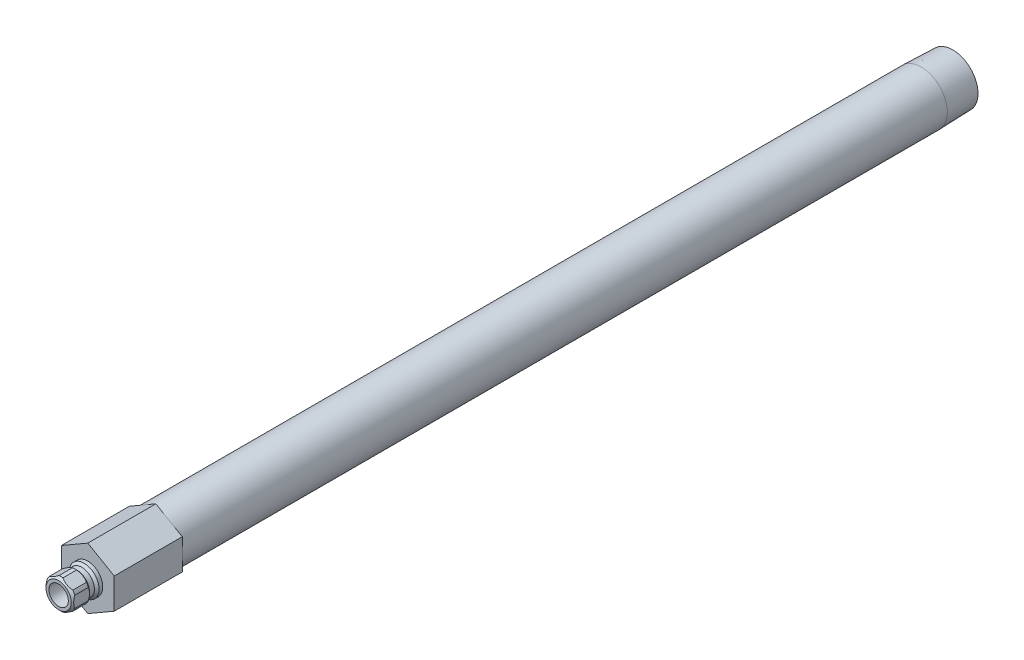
ISO-10303-21;
HEADER;
FILE_DESCRIPTION(('STEP AP214'),'2;1');
FILE_NAME('part.step','',(''),(''),'','','');
FILE_SCHEMA(('AUTOMOTIVE_DESIGN { 1 0 10303 214 1 1 1 1 }'));
ENDSEC;
DATA;
#1=APPLICATION_CONTEXT('core data for automotive mechanical design processes');
#2=APPLICATION_PROTOCOL_DEFINITION('international standard','automotive_design',2000,#1);
#3=PRODUCT_CONTEXT('',#1,'mechanical');
#4=PRODUCT('Part','Part','',(#3));
#5=PRODUCT_RELATED_PRODUCT_CATEGORY('part','',(#4));
#6=PRODUCT_DEFINITION_FORMATION('','',#4);
#7=PRODUCT_DEFINITION_CONTEXT('part definition',#1,'design');
#8=PRODUCT_DEFINITION('design','',#6,#7);
#9=PRODUCT_DEFINITION_SHAPE('','',#8);
#10=(LENGTH_UNIT() NAMED_UNIT(*) SI_UNIT(.MILLI.,.METRE.));
#11=(NAMED_UNIT(*) PLANE_ANGLE_UNIT() SI_UNIT($,.RADIAN.));
#12=(NAMED_UNIT(*) SI_UNIT($,.STERADIAN.) SOLID_ANGLE_UNIT());
#13=UNCERTAINTY_MEASURE_WITH_UNIT(LENGTH_MEASURE(1.E-05),#10,'distance_accuracy_value','');
#14=(GEOMETRIC_REPRESENTATION_CONTEXT(3) GLOBAL_UNCERTAINTY_ASSIGNED_CONTEXT((#13)) GLOBAL_UNIT_ASSIGNED_CONTEXT((#10,
#11,#12)) REPRESENTATION_CONTEXT('',''));
#15=CARTESIAN_POINT('',(0.,0.,0.));
#16=DIRECTION('',(0.,0.,1.));
#17=DIRECTION('',(1.,0.,0.));
#18=AXIS2_PLACEMENT_3D('',#15,#16,#17);
#19=CARTESIAN_POINT('',(0.,0.,0.));
#20=DIRECTION('',(0.,0.,-1.));
#21=DIRECTION('',(0.,1.,0.));
#22=AXIS2_PLACEMENT_3D('',#19,#20,#21);
#23=CYLINDRICAL_SURFACE('',#22,4.8895);
#24=DIRECTION('',(0.,0.,-1.));
#25=VECTOR('',#24,1.);
#26=CARTESIAN_POINT('',(4.5212,1.86170910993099,0.));
#27=LINE('',#26,#25);
#28=CARTESIAN_POINT('',(4.5212,1.86170910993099,4.318));
#29=VERTEX_POINT('',#28);
#30=CARTESIAN_POINT('',(4.5212,1.86170910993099,8.763));
#31=VERTEX_POINT('',#30);
#32=EDGE_CURVE('E404',#29,#31,#27,.F.);
#33=ORIENTED_EDGE('',*,*,#32,.F.);
#34=CARTESIAN_POINT('',(0.,0.,4.318));
#35=DIRECTION('',(0.,0.,-1.));
#36=DIRECTION('',(0.,1.,0.));
#37=AXIS2_PLACEMENT_3D('',#34,#35,#36);
#38=CIRCLE('',#37,4.8895);
#39=CARTESIAN_POINT('',(3.87288738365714,2.98461950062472,4.318));
#40=VERTEX_POINT('',#39);
#41=EDGE_CURVE('E206',#40,#29,#38,.T.);
#42=ORIENTED_EDGE('',*,*,#41,.F.);
#43=DIRECTION('',(0.,0.,-1.));
#44=VECTOR('',#43,1.);
#45=CARTESIAN_POINT('',(3.87288738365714,2.98461950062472,0.));
#46=LINE('',#45,#44);
#47=CARTESIAN_POINT('',(3.87288738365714,2.98461950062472,8.763));
#48=VERTEX_POINT('',#47);
#49=EDGE_CURVE('E392',#48,#40,#46,.T.);
#50=ORIENTED_EDGE('',*,*,#49,.F.);
#51=CARTESIAN_POINT('',(0.,0.,8.763));
#52=DIRECTION('',(0.,0.,-1.));
#53=DIRECTION('',(0.,1.,0.));
#54=AXIS2_PLACEMENT_3D('',#51,#52,#53);
#55=CIRCLE('',#54,4.8895);
#56=EDGE_CURVE('E193',#48,#31,#55,.T.);
#57=ORIENTED_EDGE('',*,*,#56,.T.);
#58=EDGE_LOOP('',(#33,#42,#50,#57));
#59=FACE_BOUND('',#58,.T.);
#60=ADVANCED_FACE('F34',(#59),#23,.T.);
#61=DIRECTION('',(0.,0.,-1.));
#62=VECTOR('',#61,1.);
#63=CARTESIAN_POINT('',(0.648312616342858,4.84632861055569,0.));
#64=LINE('',#63,#62);
#65=CARTESIAN_POINT('',(0.648312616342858,4.84632861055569,4.318));
#66=VERTEX_POINT('',#65);
#67=CARTESIAN_POINT('',(0.648312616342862,4.84632861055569,8.763));
#68=VERTEX_POINT('',#67);
#69=EDGE_CURVE('E311',#66,#68,#64,.F.);
#70=ORIENTED_EDGE('',*,*,#69,.F.);
#71=CARTESIAN_POINT('',(-0.648312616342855,4.84632861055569,4.318));
#72=VERTEX_POINT('',#71);
#73=EDGE_CURVE('E202',#72,#66,#38,.T.);
#74=ORIENTED_EDGE('',*,*,#73,.F.);
#75=DIRECTION('',(0.,0.,-1.));
#76=VECTOR('',#75,1.);
#77=CARTESIAN_POINT('',(-0.648312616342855,4.84632861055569,0.));
#78=LINE('',#77,#76);
#79=CARTESIAN_POINT('',(-0.648312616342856,4.84632861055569,8.763));
#80=VERTEX_POINT('',#79);
#81=EDGE_CURVE('E391',#80,#72,#78,.T.);
#82=ORIENTED_EDGE('',*,*,#81,.F.);
#83=EDGE_CURVE('E196',#80,#68,#55,.T.);
#84=ORIENTED_EDGE('',*,*,#83,.T.);
#85=EDGE_LOOP('',(#70,#74,#82,#84));
#86=FACE_BOUND('',#85,.T.);
#87=ADVANCED_FACE('F345',(#86),#23,.T.);
#88=DIRECTION('',(0.,0.,-1.));
#89=VECTOR('',#88,1.);
#90=CARTESIAN_POINT('',(-3.87288738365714,2.98461950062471,0.));
#91=LINE('',#90,#89);
#92=CARTESIAN_POINT('',(-3.87288738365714,2.98461950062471,4.318));
#93=VERTEX_POINT('',#92);
#94=CARTESIAN_POINT('',(-3.87288738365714,2.98461950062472,8.763));
#95=VERTEX_POINT('',#94);
#96=EDGE_CURVE('E54',#93,#95,#91,.F.);
#97=ORIENTED_EDGE('',*,*,#96,.F.);
#98=CARTESIAN_POINT('',(-4.5212,1.86170910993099,4.318));
#99=VERTEX_POINT('',#98);
#100=EDGE_CURVE('E205',#99,#93,#38,.T.);
#101=ORIENTED_EDGE('',*,*,#100,.F.);
#102=DIRECTION('',(0.,0.,-1.));
#103=VECTOR('',#102,1.);
#104=CARTESIAN_POINT('',(-4.5212,1.86170910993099,0.));
#105=LINE('',#104,#103);
#106=CARTESIAN_POINT('',(-4.5212,1.86170910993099,8.763));
#107=VERTEX_POINT('',#106);
#108=EDGE_CURVE('E378',#107,#99,#105,.T.);
#109=ORIENTED_EDGE('',*,*,#108,.F.);
#110=EDGE_CURVE('E195',#107,#95,#55,.T.);
#111=ORIENTED_EDGE('',*,*,#110,.T.);
#112=EDGE_LOOP('',(#97,#101,#109,#111));
#113=FACE_BOUND('',#112,.T.);
#114=ADVANCED_FACE('F350',(#113),#23,.T.);
#115=DIRECTION('',(0.,0.,-1.));
#116=VECTOR('',#115,1.);
#117=CARTESIAN_POINT('',(-4.5212,-1.86170910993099,0.));
#118=LINE('',#117,#116);
#119=CARTESIAN_POINT('',(-4.5212,-1.86170910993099,4.318));
#120=VERTEX_POINT('',#119);
#121=CARTESIAN_POINT('',(-4.5212,-1.86170910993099,8.763));
#122=VERTEX_POINT('',#121);
#123=EDGE_CURVE('E62',#120,#122,#118,.F.);
#124=ORIENTED_EDGE('',*,*,#123,.F.);
#125=CARTESIAN_POINT('',(-3.87288738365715,-2.98461950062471,4.318));
#126=VERTEX_POINT('',#125);
#127=EDGE_CURVE('E377',#126,#120,#38,.T.);
#128=ORIENTED_EDGE('',*,*,#127,.F.);
#129=DIRECTION('',(0.,0.,-1.));
#130=VECTOR('',#129,1.);
#131=CARTESIAN_POINT('',(-3.87288738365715,-2.98461950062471,0.));
#132=LINE('',#131,#130);
#133=CARTESIAN_POINT('',(-3.87288738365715,-2.98461950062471,8.763));
#134=VERTEX_POINT('',#133);
#135=EDGE_CURVE('E265',#134,#126,#132,.T.);
#136=ORIENTED_EDGE('',*,*,#135,.F.);
#137=EDGE_CURVE('E191',#134,#122,#55,.T.);
#138=ORIENTED_EDGE('',*,*,#137,.T.);
#139=EDGE_LOOP('',(#124,#128,#136,#138));
#140=FACE_BOUND('',#139,.T.);
#141=ADVANCED_FACE('F362',(#140),#23,.T.);
#142=DIRECTION('',(0.,0.,-1.));
#143=VECTOR('',#142,1.);
#144=CARTESIAN_POINT('',(-0.648312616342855,-4.84632861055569,0.));
#145=LINE('',#144,#143);
#146=CARTESIAN_POINT('',(-0.648312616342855,-4.84632861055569,4.318));
#147=VERTEX_POINT('',#146);
#148=CARTESIAN_POINT('',(-0.648312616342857,-4.84632861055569,8.763));
#149=VERTEX_POINT('',#148);
#150=EDGE_CURVE('E394',#147,#149,#145,.F.);
#151=ORIENTED_EDGE('',*,*,#150,.F.);
#152=CARTESIAN_POINT('',(0.648312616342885,-4.84632861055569,4.318));
#153=VERTEX_POINT('',#152);
#154=EDGE_CURVE('E183',#153,#147,#38,.T.);
#155=ORIENTED_EDGE('',*,*,#154,.F.);
#156=DIRECTION('',(0.,0.,-1.));
#157=VECTOR('',#156,1.);
#158=CARTESIAN_POINT('',(0.648312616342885,-4.84632861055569,0.));
#159=LINE('',#158,#157);
#160=CARTESIAN_POINT('',(0.648312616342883,-4.84632861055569,8.763));
#161=VERTEX_POINT('',#160);
#162=EDGE_CURVE('E165',#161,#153,#159,.T.);
#163=ORIENTED_EDGE('',*,*,#162,.F.);
#164=EDGE_CURVE('E181',#161,#149,#55,.T.);
#165=ORIENTED_EDGE('',*,*,#164,.T.);
#166=EDGE_LOOP('',(#151,#155,#163,#165));
#167=FACE_BOUND('',#166,.T.);
#168=ADVANCED_FACE('F180',(#167),#23,.T.);
#169=CARTESIAN_POINT('',(0.,0.,0.));
#170=DIRECTION('',(0.,0.,-1.));
#171=DIRECTION('',(0.,1.,0.));
#172=AXIS2_PLACEMENT_3D('',#169,#170,#171);
#173=CYLINDRICAL_SURFACE('',#172,8.57249999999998);
#174=CARTESIAN_POINT('',(0.,0.,-272.2372));
#175=DIRECTION('',(0.,0.,-1.));
#176=DIRECTION('',(0.,1.,0.));
#177=AXIS2_PLACEMENT_3D('',#174,#175,#176);
#178=CIRCLE('',#177,8.57249999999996);
#179=CARTESIAN_POINT('',(0.,8.5725,-272.2372));
#180=VERTEX_POINT('',#179);
#181=EDGE_CURVE('E219',#180,#180,#178,.T.);
#182=ORIENTED_EDGE('',*,*,#181,.F.);
#183=EDGE_LOOP('',(#182));
#184=FACE_BOUND('',#183,.T.);
#185=CARTESIAN_POINT('',(0.,0.,-22.225));
#186=DIRECTION('',(0.,0.,1.));
#187=DIRECTION('',(1.,0.,0.));
#188=AXIS2_PLACEMENT_3D('',#185,#186,#187);
#189=CIRCLE('',#188,8.57249999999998);
#190=CARTESIAN_POINT('',(8.57249999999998,0.,-22.225));
#191=VERTEX_POINT('',#190);
#192=EDGE_CURVE('E233',#191,#191,#189,.F.);
#193=ORIENTED_EDGE('',*,*,#192,.T.);
#194=EDGE_LOOP('',(#193));
#195=FACE_BOUND('',#194,.T.);
#196=ADVANCED_FACE('F361',(#184,#195),#173,.T.);
#197=CARTESIAN_POINT('',(0.,0.,0.));
#198=DIRECTION('',(0.,0.,-1.));
#199=DIRECTION('',(0.,1.,0.));
#200=AXIS2_PLACEMENT_3D('',#197,#198,#199);
#201=CYLINDRICAL_SURFACE('',#200,3.175);
#202=CARTESIAN_POINT('',(0.,0.,9.525));
#203=DIRECTION('',(0.,0.,-1.));
#204=DIRECTION('',(0.,1.,0.));
#205=AXIS2_PLACEMENT_3D('',#202,#203,#204);
#206=CIRCLE('',#205,3.175);
#207=CARTESIAN_POINT('',(0.,3.175,9.525));
#208=VERTEX_POINT('',#207);
#209=EDGE_CURVE('E235',#208,#208,#206,.T.);
#210=ORIENTED_EDGE('',*,*,#209,.F.);
#211=EDGE_LOOP('',(#210));
#212=FACE_BOUND('',#211,.T.);
#213=CARTESIAN_POINT('',(0.,0.,-22.225));
#214=DIRECTION('',(0.,0.,-1.));
#215=DIRECTION('',(0.,1.,0.));
#216=AXIS2_PLACEMENT_3D('',#213,#214,#215);
#217=CIRCLE('',#216,3.175);
#218=CARTESIAN_POINT('',(0.,3.175,-22.225));
#219=VERTEX_POINT('',#218);
#220=EDGE_CURVE('E174',#219,#219,#217,.T.);
#221=ORIENTED_EDGE('',*,*,#220,.T.);
#222=EDGE_LOOP('',(#221));
#223=FACE_BOUND('',#222,.T.);
#224=ADVANCED_FACE('F36',(#212,#223),#201,.F.);
#225=CARTESIAN_POINT('',(0.,3.175,-22.225));
#226=DIRECTION('',(0.,0.,-1.));
#227=DIRECTION('',(0.,1.,0.));
#228=AXIS2_PLACEMENT_3D('',#225,#226,#227);
#229=PLANE('',#228);
#230=CARTESIAN_POINT('',(0.,0.,-22.225));
#231=DIRECTION('',(0.,0.,-1.));
#232=DIRECTION('',(0.,1.,0.));
#233=AXIS2_PLACEMENT_3D('',#230,#231,#232);
#234=CIRCLE('',#233,6.2611);
#235=CARTESIAN_POINT('',(0.,6.2611,-22.225));
#236=VERTEX_POINT('',#235);
#237=EDGE_CURVE('E228',#236,#236,#234,.T.);
#238=ORIENTED_EDGE('',*,*,#237,.T.);
#239=EDGE_LOOP('',(#238));
#240=FACE_BOUND('',#239,.T.);
#241=ORIENTED_EDGE('',*,*,#220,.F.);
#242=EDGE_LOOP('',(#241));
#243=FACE_BOUND('',#242,.T.);
#244=ADVANCED_FACE('F533',(#240,#243),#229,.T.);
#245=CARTESIAN_POINT('',(0.,0.,0.));
#246=DIRECTION('',(0.,0.,-1.));
#247=DIRECTION('',(0.,1.,0.));
#248=AXIS2_PLACEMENT_3D('',#245,#246,#247);
#249=CYLINDRICAL_SURFACE('',#248,6.26109999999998);
#250=CARTESIAN_POINT('',(0.,0.,-282.575));
#251=DIRECTION('',(0.,0.,-1.));
#252=DIRECTION('',(0.,1.,0.));
#253=AXIS2_PLACEMENT_3D('',#250,#251,#252);
#254=CIRCLE('',#253,6.26109999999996);
#255=CARTESIAN_POINT('',(0.,6.2611,-282.575));
#256=VERTEX_POINT('',#255);
#257=EDGE_CURVE('E225',#256,#256,#254,.T.);
#258=ORIENTED_EDGE('',*,*,#257,.T.);
#259=EDGE_LOOP('',(#258));
#260=FACE_BOUND('',#259,.T.);
#261=ORIENTED_EDGE('',*,*,#237,.F.);
#262=EDGE_LOOP('',(#261));
#263=FACE_BOUND('',#262,.T.);
#264=ADVANCED_FACE('F530',(#260,#263),#249,.F.);
#265=CARTESIAN_POINT('',(0.,8.24944566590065,-282.575));
#266=DIRECTION('',(0.,0.,-1.));
#267=DIRECTION('',(0.,1.,0.));
#268=AXIS2_PLACEMENT_3D('',#265,#266,#267);
#269=PLANE('',#268);
#270=CARTESIAN_POINT('',(0.,0.,-282.575));
#271=DIRECTION('',(0.,0.,-1.));
#272=DIRECTION('',(0.,1.,0.));
#273=AXIS2_PLACEMENT_3D('',#270,#271,#272);
#274=CIRCLE('',#273,8.24944566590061);
#275=CARTESIAN_POINT('',(0.,8.24944566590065,-282.575));
#276=VERTEX_POINT('',#275);
#277=EDGE_CURVE('E222',#276,#276,#274,.T.);
#278=ORIENTED_EDGE('',*,*,#277,.T.);
#279=EDGE_LOOP('',(#278));
#280=FACE_BOUND('',#279,.T.);
#281=ORIENTED_EDGE('',*,*,#257,.F.);
#282=EDGE_LOOP('',(#281));
#283=FACE_BOUND('',#282,.T.);
#284=ADVANCED_FACE('F524',(#280,#283),#269,.T.);
#285=CARTESIAN_POINT('',(0.,0.,-282.575));
#286=DIRECTION('',(0.,0.,1.));
#287=DIRECTION('',(0.,-1.,0.));
#288=AXIS2_PLACEMENT_3D('',#285,#286,#287);
#289=CONICAL_SURFACE('',#288,8.24944566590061,0.0312396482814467);
#290=ORIENTED_EDGE('',*,*,#181,.T.);
#291=EDGE_LOOP('',(#290));
#292=FACE_BOUND('',#291,.T.);
#293=ORIENTED_EDGE('',*,*,#277,.F.);
#294=EDGE_LOOP('',(#293));
#295=FACE_BOUND('',#294,.T.);
#296=ADVANCED_FACE('F514',(#292,#295),#289,.T.);
#297=CARTESIAN_POINT('',(0.,4.8895,0.));
#298=DIRECTION('',(0.,0.,1.));
#299=DIRECTION('',(0.,-1.,0.));
#300=AXIS2_PLACEMENT_3D('',#297,#298,#299);
#301=PLANE('',#300);
#302=CARTESIAN_POINT('',(0.,0.,0.));
#303=DIRECTION('',(0.,0.,-1.));
#304=DIRECTION('',(0.,1.,0.));
#305=AXIS2_PLACEMENT_3D('',#302,#303,#304);
#306=CIRCLE('',#305,4.8895);
#307=CARTESIAN_POINT('',(0.,4.8895,0.));
#308=VERTEX_POINT('',#307);
#309=EDGE_CURVE('E216',#308,#308,#306,.T.);
#310=ORIENTED_EDGE('',*,*,#309,.T.);
#311=EDGE_LOOP('',(#310));
#312=FACE_BOUND('',#311,.T.);
#313=DIRECTION('',(-0.866025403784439,-0.5,0.));
#314=VECTOR('',#313,1.);
#315=CARTESIAN_POINT('',(0.,9.97199384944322,0.));
#316=LINE('',#315,#314);
#317=CARTESIAN_POINT('',(0.,9.97199384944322,0.));
#318=VERTEX_POINT('',#317);
#319=CARTESIAN_POINT('',(-8.636,4.98599692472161,0.));
#320=VERTEX_POINT('',#319);
#321=EDGE_CURVE('E409',#318,#320,#316,.T.);
#322=ORIENTED_EDGE('',*,*,#321,.T.);
#323=DIRECTION('',(0.,-1.,0.));
#324=VECTOR('',#323,1.);
#325=CARTESIAN_POINT('',(-8.636,4.98599692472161,0.));
#326=LINE('',#325,#324);
#327=CARTESIAN_POINT('',(-8.636,-4.98599692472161,0.));
#328=VERTEX_POINT('',#327);
#329=EDGE_CURVE('E436',#320,#328,#326,.T.);
#330=ORIENTED_EDGE('',*,*,#329,.T.);
#331=DIRECTION('',(0.866025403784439,-0.5,0.));
#332=VECTOR('',#331,1.);
#333=CARTESIAN_POINT('',(-8.636,-4.98599692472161,0.));
#334=LINE('',#333,#332);
#335=CARTESIAN_POINT('',(0.,-9.97199384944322,0.));
#336=VERTEX_POINT('',#335);
#337=EDGE_CURVE('E439',#328,#336,#334,.T.);
#338=ORIENTED_EDGE('',*,*,#337,.T.);
#339=DIRECTION('',(0.866025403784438,0.5,0.));
#340=VECTOR('',#339,1.);
#341=CARTESIAN_POINT('',(0.,-9.97199384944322,0.));
#342=LINE('',#341,#340);
#343=CARTESIAN_POINT('',(8.636,-4.98599692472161,0.));
#344=VERTEX_POINT('',#343);
#345=EDGE_CURVE('E442',#336,#344,#342,.T.);
#346=ORIENTED_EDGE('',*,*,#345,.T.);
#347=DIRECTION('',(0.,1.,0.));
#348=VECTOR('',#347,1.);
#349=CARTESIAN_POINT('',(8.636,-4.98599692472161,0.));
#350=LINE('',#349,#348);
#351=CARTESIAN_POINT('',(8.636,4.98599692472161,0.));
#352=VERTEX_POINT('',#351);
#353=EDGE_CURVE('E445',#344,#352,#350,.T.);
#354=ORIENTED_EDGE('',*,*,#353,.T.);
#355=DIRECTION('',(-0.866025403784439,0.5,0.));
#356=VECTOR('',#355,1.);
#357=CARTESIAN_POINT('',(8.636,4.98599692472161,0.));
#358=LINE('',#357,#356);
#359=EDGE_CURVE('E418',#352,#318,#358,.T.);
#360=ORIENTED_EDGE('',*,*,#359,.T.);
#361=EDGE_LOOP('',(#322,#330,#338,#346,#354,#360));
#362=FACE_BOUND('',#361,.T.);
#363=ADVANCED_FACE('F511',(#312,#362),#301,.T.);
#364=CARTESIAN_POINT('',(0.,0.,0.));
#365=DIRECTION('',(0.,0.,-1.));
#366=DIRECTION('',(0.,1.,0.));
#367=AXIS2_PLACEMENT_3D('',#364,#365,#366);
#368=CYLINDRICAL_SURFACE('',#367,4.8895);
#369=CARTESIAN_POINT('',(0.,0.,1.2065));
#370=DIRECTION('',(0.,0.,-1.));
#371=DIRECTION('',(0.,1.,0.));
#372=AXIS2_PLACEMENT_3D('',#369,#370,#371);
#373=CIRCLE('',#372,4.8895);
#374=CARTESIAN_POINT('',(0.,4.8895,1.2065));
#375=VERTEX_POINT('',#374);
#376=EDGE_CURVE('E213',#375,#375,#373,.T.);
#377=ORIENTED_EDGE('',*,*,#376,.T.);
#378=EDGE_LOOP('',(#377));
#379=FACE_BOUND('',#378,.T.);
#380=ORIENTED_EDGE('',*,*,#309,.F.);
#381=EDGE_LOOP('',(#380));
#382=FACE_BOUND('',#381,.T.);
#383=ADVANCED_FACE('F513',(#379,#382),#368,.T.);
#384=CARTESIAN_POINT('',(0.,0.,1.2065));
#385=DIRECTION('',(0.,0.,-1.));
#386=DIRECTION('',(0.,1.,0.));
#387=AXIS2_PLACEMENT_3D('',#384,#385,#386);
#388=CONICAL_SURFACE('',#387,4.8895,0.785398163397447);
#389=CARTESIAN_POINT('',(0.,0.,1.9685));
#390=DIRECTION('',(0.,0.,-1.));
#391=DIRECTION('',(0.,1.,0.));
#392=AXIS2_PLACEMENT_3D('',#389,#390,#391);
#393=CIRCLE('',#392,4.1275);
#394=CARTESIAN_POINT('',(0.,4.1275,1.9685));
#395=VERTEX_POINT('',#394);
#396=EDGE_CURVE('E210',#395,#395,#393,.T.);
#397=ORIENTED_EDGE('',*,*,#396,.T.);
#398=EDGE_LOOP('',(#397));
#399=FACE_BOUND('',#398,.T.);
#400=ORIENTED_EDGE('',*,*,#376,.F.);
#401=EDGE_LOOP('',(#400));
#402=FACE_BOUND('',#401,.T.);
#403=ADVANCED_FACE('F521',(#399,#402),#388,.T.);
#404=CARTESIAN_POINT('',(0.,0.,0.));
#405=DIRECTION('',(0.,0.,-1.));
#406=DIRECTION('',(0.,1.,0.));
#407=AXIS2_PLACEMENT_3D('',#404,#405,#406);
#408=CYLINDRICAL_SURFACE('',#407,4.1275);
#409=CARTESIAN_POINT('',(0.,0.,3.556));
#410=DIRECTION('',(0.,0.,-1.));
#411=DIRECTION('',(0.,1.,0.));
#412=AXIS2_PLACEMENT_3D('',#409,#410,#411);
#413=CIRCLE('',#412,4.1275);
#414=CARTESIAN_POINT('',(0.,4.1275,3.556));
#415=VERTEX_POINT('',#414);
#416=EDGE_CURVE('E207',#415,#415,#413,.T.);
#417=ORIENTED_EDGE('',*,*,#416,.T.);
#418=EDGE_LOOP('',(#417));
#419=FACE_BOUND('',#418,.T.);
#420=ORIENTED_EDGE('',*,*,#396,.F.);
#421=EDGE_LOOP('',(#420));
#422=FACE_BOUND('',#421,.T.);
#423=ADVANCED_FACE('F272',(#419,#422),#408,.T.);
#424=CARTESIAN_POINT('',(0.,0.,3.556));
#425=DIRECTION('',(0.,0.,1.));
#426=DIRECTION('',(0.,-1.,0.));
#427=AXIS2_PLACEMENT_3D('',#424,#425,#426);
#428=CONICAL_SURFACE('',#427,4.1275,0.785398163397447);
#429=CARTESIAN_POINT('',(4.52119999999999,-5.15925306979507,6.28846659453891));
#430=CARTESIAN_POINT('',(4.52119999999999,-5.03341781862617,6.19384981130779));
#431=CARTESIAN_POINT('',(4.52119999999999,-4.90687282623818,6.100161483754));
#432=CARTESIAN_POINT('',(4.52119999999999,-4.65208542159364,5.91505573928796));
#433=CARTESIAN_POINT('',(4.52119999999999,-4.52384258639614,5.8236389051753));
#434=CARTESIAN_POINT('',(4.52119999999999,-4.26444371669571,5.64284060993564));
#435=CARTESIAN_POINT('',(4.52119999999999,-4.1332728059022,5.5534804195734));
#436=CARTESIAN_POINT('',(4.52119999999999,-3.86869655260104,5.37814219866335));
#437=CARTESIAN_POINT('',(4.52119999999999,-3.73529136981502,5.29216392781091));
#438=CARTESIAN_POINT('',(4.52119999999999,-3.45835736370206,5.11964219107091));
#439=CARTESIAN_POINT('',(4.52119999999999,-3.31467977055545,5.03333631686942));
#440=CARTESIAN_POINT('',(4.52119999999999,-3.02397608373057,4.86646929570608));
#441=CARTESIAN_POINT('',(4.52119999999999,-2.87694947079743,4.78590904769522));
#442=CARTESIAN_POINT('',(4.52119999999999,-2.57957206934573,4.6322757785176));
#443=CARTESIAN_POINT('',(4.52119999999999,-2.42923274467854,4.55918074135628));
#444=CARTESIAN_POINT('',(4.52119999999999,-2.12448469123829,4.4221138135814));
#445=CARTESIAN_POINT('',(4.52119999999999,-1.97007782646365,4.35813782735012));
#446=CARTESIAN_POINT('',(4.52119999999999,-1.66898205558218,4.24604782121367));
#447=CARTESIAN_POINT('',(4.52119999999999,-1.52260919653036,4.19709368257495));
#448=CARTESIAN_POINT('',(4.52119999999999,-1.22638031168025,4.11093488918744));
#449=CARTESIAN_POINT('',(4.52119999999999,-1.07652404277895,4.07373105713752));
#450=CARTESIAN_POINT('',(4.52119999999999,-0.776693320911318,4.01362130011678));
#451=CARTESIAN_POINT('',(4.52119999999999,-0.626768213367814,3.99047322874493));
#452=CARTESIAN_POINT('',(4.52119999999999,-0.325366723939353,3.95891692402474));
#453=CARTESIAN_POINT('',(4.52119999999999,-0.173890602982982,3.95050625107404));
#454=CARTESIAN_POINT('',(4.52119999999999,0.123852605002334,3.94903068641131));
#455=CARTESIAN_POINT('',(4.52119999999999,0.270117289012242,3.95544130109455));
#456=CARTESIAN_POINT('',(4.52119999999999,0.561370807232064,3.98210770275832));
#457=CARTESIAN_POINT('',(4.5212,0.706359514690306,4.0023648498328));
#458=CARTESIAN_POINT('',(4.5212,0.996462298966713,4.05597163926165));
#459=CARTESIAN_POINT('',(4.5212,1.14153485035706,4.08954247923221));
#460=CARTESIAN_POINT('',(4.5212,1.42852462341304,4.1680002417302));
#461=CARTESIAN_POINT('',(4.5212,1.57044212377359,4.21288616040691));
#462=CARTESIAN_POINT('',(4.5212,1.86505501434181,4.31714129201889));
#463=CARTESIAN_POINT('',(4.5212,2.01739126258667,4.377515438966));
#464=CARTESIAN_POINT('',(4.5212,2.31809735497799,4.50751823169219));
#465=CARTESIAN_POINT('',(4.5212,2.46646529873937,4.57715121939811));
#466=CARTESIAN_POINT('',(4.5212,2.75996557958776,4.72401353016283));
#467=CARTESIAN_POINT('',(4.5212,2.9050858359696,4.80126680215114));
#468=CARTESIAN_POINT('',(4.5212,3.19198335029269,4.96166050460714));
#469=CARTESIAN_POINT('',(4.5212,3.33376113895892,5.04479999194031));
#470=CARTESIAN_POINT('',(4.5212,3.60742153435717,5.21154136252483));
#471=CARTESIAN_POINT('',(4.5212,3.73944496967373,5.29491333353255));
#472=CARTESIAN_POINT('',(4.5212,4.00122581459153,5.46515273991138));
#473=CARTESIAN_POINT('',(4.5212,4.13098305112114,5.55202044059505));
#474=CARTESIAN_POINT('',(4.5212,4.38747396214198,5.72790624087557));
#475=CARTESIAN_POINT('',(4.5212,4.51422365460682,5.81690106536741));
#476=CARTESIAN_POINT('',(4.5212,4.76599253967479,5.99723636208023));
#477=CARTESIAN_POINT('',(4.5212,4.89101219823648,6.08857618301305));
#478=CARTESIAN_POINT('',(4.5212,5.0153077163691,6.18087446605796));
#479=B_SPLINE_CURVE_WITH_KNOTS('',3,(#429,#430,#431,#432,#433,#434,#435,#436,#437,#438,#439,
#440,#441,#442,#443,#444,#445,#446,#447,#448,#449,#450,#451,#452,#453,#454,#455,#456,#457,#458,
#459,#460,#461,#462,#463,#464,#465,#466,#467,#468,#469,#470,#471,#472,#473,#474,#475,#476,#477,
#478),.UNSPECIFIED.,.F.,.F.,(4,2,2,2,2,2,2,2,2,2,2,2,2,2,2,2,2,2,2,2,2,2,2,2,4),(0.,
0.472324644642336,0.944769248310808,1.42087610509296,1.89694907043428,2.39966187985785,
2.90245317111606,3.40371602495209,3.90475303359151,4.36737130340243,4.83002195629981,
5.28445770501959,5.73881822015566,6.17734710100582,6.61591906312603,7.06210522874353,
7.5082518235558,7.99945943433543,8.49089821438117,8.98393391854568,9.4768908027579,
9.94525924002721,10.4136632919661,10.8782525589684,11.3427141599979),.UNSPECIFIED.);
#480=CARTESIAN_POINT('',(4.52119999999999,-1.861709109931,4.318));
#481=VERTEX_POINT('',#480);
#482=EDGE_CURVE('E407',#481,#29,#479,.T.);
#483=ORIENTED_EDGE('',*,*,#482,.F.);
#484=CARTESIAN_POINT('',(3.87288738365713,-2.98461950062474,4.318));
#485=VERTEX_POINT('',#484);
#486=EDGE_CURVE('E385',#481,#485,#38,.T.);
#487=ORIENTED_EDGE('',*,*,#486,.T.);
#488=CARTESIAN_POINT('',(0.647857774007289,-4.84659121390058,4.3182));
#489=CARTESIAN_POINT('',(0.775261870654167,-4.77303442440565,4.26213711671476));
#490=CARTESIAN_POINT('',(0.904457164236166,-4.69844348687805,4.21102627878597));
#491=CARTESIAN_POINT('',(1.16629518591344,-4.5472712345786,4.1207431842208));
#492=CARTESIAN_POINT('',(1.29894624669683,-4.47068510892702,4.08160338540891));
#493=CARTESIAN_POINT('',(1.56203676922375,-4.31878972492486,4.01877592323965));
#494=CARTESIAN_POINT('',(1.69238331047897,-4.24353411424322,3.99458163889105));
#495=CARTESIAN_POINT('',(1.95434729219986,-4.09228913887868,3.96102228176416));
#496=CARTESIAN_POINT('',(2.08596281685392,-4.01630088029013,3.95163757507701));
#497=CARTESIAN_POINT('',(2.3562305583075,-3.86026172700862,3.94821923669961));
#498=CARTESIAN_POINT('',(2.49489129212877,-3.78020591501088,3.95501290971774));
#499=CARTESIAN_POINT('',(2.7710334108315,-3.62077518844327,3.9851849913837));
#500=CARTESIAN_POINT('',(2.90851272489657,-3.5414014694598,4.00858815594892));
#501=CARTESIAN_POINT('',(3.18622016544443,-3.38106700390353,4.07155129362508));
#502=CARTESIAN_POINT('',(3.32634361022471,-3.30016669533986,4.11171074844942));
#503=CARTESIAN_POINT('',(3.60275664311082,-3.14057955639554,4.20550294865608));
#504=CARTESIAN_POINT('',(3.73905611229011,-3.06188702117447,4.25909654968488));
#505=CARTESIAN_POINT('',(3.87334222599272,-2.98435689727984,4.3182));
#506=B_SPLINE_CURVE_WITH_KNOTS('',3,(#488,#489,#490,#491,#492,#493,#494,#495,#496,#497,#498,
#499,#500,#501,#502,#503,#504,#505),.UNSPECIFIED.,.F.,.F.,(4,2,2,2,2,2,2,2,4),(0.,
0.472469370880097,0.946208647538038,1.40285320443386,1.85889185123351,2.33874707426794,
2.81931901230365,3.31879975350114,3.81684169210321),.UNSPECIFIED.);
#507=EDGE_CURVE('E258',#153,#485,#506,.T.);
#508=ORIENTED_EDGE('',*,*,#507,.F.);
#509=ORIENTED_EDGE('',*,*,#154,.T.);
#510=CARTESIAN_POINT('',(-3.87334222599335,-2.98435689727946,4.31820000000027));
#511=CARTESIAN_POINT('',(-3.74593812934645,-3.05791368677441,4.262137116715));
#512=CARTESIAN_POINT('',(-3.61674283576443,-3.13250462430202,4.21102627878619));
#513=CARTESIAN_POINT('',(-3.35490481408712,-3.2836768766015,4.12074318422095));
#514=CARTESIAN_POINT('',(-3.2222537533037,-3.36026300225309,4.08160338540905));
#515=CARTESIAN_POINT('',(-2.95916323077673,-3.51215838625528,4.01877592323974));
#516=CARTESIAN_POINT('',(-2.82881668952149,-3.58741399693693,3.99458163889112));
#517=CARTESIAN_POINT('',(-2.56685270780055,-3.73865897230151,3.96102228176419));
#518=CARTESIAN_POINT('',(-2.43523718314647,-3.81464723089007,3.95163757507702));
#519=CARTESIAN_POINT('',(-2.16496944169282,-3.97068638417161,3.94821923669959));
#520=CARTESIAN_POINT('',(-2.02630870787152,-4.05074219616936,3.9550129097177));
#521=CARTESIAN_POINT('',(-1.75016658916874,-4.21017292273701,3.98518499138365));
#522=CARTESIAN_POINT('',(-1.61268727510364,-4.2895466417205,4.00858815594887));
#523=CARTESIAN_POINT('',(-1.33497983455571,-4.44988110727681,4.07155129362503));
#524=CARTESIAN_POINT('',(-1.1948563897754,-4.5307814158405,4.11171074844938));
#525=CARTESIAN_POINT('',(-0.918443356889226,-4.69036855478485,4.20550294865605));
#526=CARTESIAN_POINT('',(-0.782143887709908,-4.76906109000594,4.25909654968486));
#527=CARTESIAN_POINT('',(-0.647857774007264,-4.84659121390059,4.3182));
#528=B_SPLINE_CURVE_WITH_KNOTS('',3,(#510,#511,#512,#513,#514,#515,#516,#517,#518,#519,#520,
#521,#522,#523,#524,#525,#526,#527),.UNSPECIFIED.,.F.,.F.,(4,2,2,2,2,2,2,2,4),(0.,
0.472469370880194,0.946208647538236,1.40285320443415,1.85889185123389,2.33874707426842,
2.81931901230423,3.31879975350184,3.81684169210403),.UNSPECIFIED.);
#529=EDGE_CURVE('E281',#126,#147,#528,.T.);
#530=ORIENTED_EDGE('',*,*,#529,.F.);
#531=ORIENTED_EDGE('',*,*,#127,.T.);
#532=CARTESIAN_POINT('',(-4.5212,-5.15925306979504,6.2884665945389));
#533=CARTESIAN_POINT('',(-4.5212,-5.03341781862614,6.19384981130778));
#534=CARTESIAN_POINT('',(-4.5212,-4.90687282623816,6.10016148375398));
#535=CARTESIAN_POINT('',(-4.5212,-4.65208542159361,5.91505573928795));
#536=CARTESIAN_POINT('',(-4.5212,-4.52384258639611,5.82363890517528));
#537=CARTESIAN_POINT('',(-4.5212,-4.26444371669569,5.64284060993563));
#538=CARTESIAN_POINT('',(-4.5212,-4.13327280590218,5.55348041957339));
#539=CARTESIAN_POINT('',(-4.5212,-3.86869655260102,5.37814219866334));
#540=CARTESIAN_POINT('',(-4.5212,-3.735291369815,5.2921639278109));
#541=CARTESIAN_POINT('',(-4.5212,-3.45835736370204,5.1196421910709));
#542=CARTESIAN_POINT('',(-4.5212,-3.31467977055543,5.03333631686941));
#543=CARTESIAN_POINT('',(-4.5212,-3.02397608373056,4.86646929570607));
#544=CARTESIAN_POINT('',(-4.5212,-2.87694947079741,4.78590904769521));
#545=CARTESIAN_POINT('',(-4.5212,-2.57957206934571,4.63227577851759));
#546=CARTESIAN_POINT('',(-4.5212,-2.42923274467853,4.55918074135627));
#547=CARTESIAN_POINT('',(-4.5212,-2.12448469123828,4.4221138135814));
#548=CARTESIAN_POINT('',(-4.5212,-1.97007782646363,4.35813782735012));
#549=CARTESIAN_POINT('',(-4.5212,-1.66898205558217,4.24604782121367));
#550=CARTESIAN_POINT('',(-4.5212,-1.52260919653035,4.19709368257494));
#551=CARTESIAN_POINT('',(-4.5212,-1.22638031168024,4.11093488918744));
#552=CARTESIAN_POINT('',(-4.5212,-1.07652404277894,4.07373105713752));
#553=CARTESIAN_POINT('',(-4.5212,-0.776693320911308,4.01362130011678));
#554=CARTESIAN_POINT('',(-4.5212,-0.626768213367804,3.99047322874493));
#555=CARTESIAN_POINT('',(-4.5212,-0.325366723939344,3.95891692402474));
#556=CARTESIAN_POINT('',(-4.5212,-0.173890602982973,3.95050625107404));
#557=CARTESIAN_POINT('',(-4.5212,0.123852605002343,3.94903068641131));
#558=CARTESIAN_POINT('',(-4.5212,0.270117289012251,3.95544130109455));
#559=CARTESIAN_POINT('',(-4.5212,0.561370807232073,3.98210770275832));
#560=CARTESIAN_POINT('',(-4.5212,0.706359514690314,4.0023648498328));
#561=CARTESIAN_POINT('',(-4.5212,0.996462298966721,4.05597163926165));
#562=CARTESIAN_POINT('',(-4.5212,1.14153485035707,4.08954247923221));
#563=CARTESIAN_POINT('',(-4.5212,1.42852462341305,4.16800024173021));
#564=CARTESIAN_POINT('',(-4.5212,1.5704421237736,4.21288616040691));
#565=CARTESIAN_POINT('',(-4.5212,1.86505501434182,4.31714129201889));
#566=CARTESIAN_POINT('',(-4.5212,2.01739126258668,4.377515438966));
#567=CARTESIAN_POINT('',(-4.5212,2.318097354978,4.50751823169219));
#568=CARTESIAN_POINT('',(-4.5212,2.46646529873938,4.57715121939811));
#569=CARTESIAN_POINT('',(-4.5212,2.75996557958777,4.72401353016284));
#570=CARTESIAN_POINT('',(-4.5212,2.9050858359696,4.80126680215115));
#571=CARTESIAN_POINT('',(-4.5212,3.1919833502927,4.96166050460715));
#572=CARTESIAN_POINT('',(-4.5212,3.33376113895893,5.04479999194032));
#573=CARTESIAN_POINT('',(-4.5212,3.60742153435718,5.21154136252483));
#574=CARTESIAN_POINT('',(-4.5212,3.73944496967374,5.29491333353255));
#575=CARTESIAN_POINT('',(-4.5212,4.00122581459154,5.46515273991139));
#576=CARTESIAN_POINT('',(-4.5212,4.13098305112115,5.55202044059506));
#577=CARTESIAN_POINT('',(-4.5212,4.38747396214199,5.72790624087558));
#578=CARTESIAN_POINT('',(-4.5212,4.51422365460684,5.81690106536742));
#579=CARTESIAN_POINT('',(-4.5212,4.76599253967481,5.99723636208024));
#580=CARTESIAN_POINT('',(-4.5212,4.89101219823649,6.08857618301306));
#581=CARTESIAN_POINT('',(-4.5212,5.01530771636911,6.18087446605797));
#582=B_SPLINE_CURVE_WITH_KNOTS('',3,(#532,#533,#534,#535,#536,#537,#538,#539,#540,#541,#542,
#543,#544,#545,#546,#547,#548,#549,#550,#551,#552,#553,#554,#555,#556,#557,#558,#559,#560,#561,
#562,#563,#564,#565,#566,#567,#568,#569,#570,#571,#572,#573,#574,#575,#576,#577,#578,#579,#580,
#581),.UNSPECIFIED.,.F.,.F.,(4,2,2,2,2,2,2,2,2,2,2,2,2,2,2,2,2,2,2,2,2,2,2,2,4),(0.,
0.472324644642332,0.944769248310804,1.42087610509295,1.89694907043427,2.39966187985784,
2.90245317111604,3.40371602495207,3.90475303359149,4.36737130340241,4.83002195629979,
5.28445770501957,5.73881822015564,6.1773471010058,6.615919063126,7.06210522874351,
7.50825182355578,7.9994594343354,8.49089821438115,8.98393391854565,9.47689080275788,
9.94525924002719,10.4136632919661,10.8782525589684,11.3427141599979),.UNSPECIFIED.);
#583=EDGE_CURVE('E288',#99,#120,#582,.F.);
#584=ORIENTED_EDGE('',*,*,#583,.F.);
#585=ORIENTED_EDGE('',*,*,#100,.T.);
#586=CARTESIAN_POINT('',(-0.647857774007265,4.84659121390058,4.3182));
#587=CARTESIAN_POINT('',(-0.775261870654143,4.77303442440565,4.26213711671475));
#588=CARTESIAN_POINT('',(-0.904457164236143,4.69844348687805,4.21102627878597));
#589=CARTESIAN_POINT('',(-1.16629518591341,4.5472712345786,4.12074318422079));
#590=CARTESIAN_POINT('',(-1.2989462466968,4.47068510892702,4.08160338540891));
#591=CARTESIAN_POINT('',(-1.56203676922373,4.31878972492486,4.01877592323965));
#592=CARTESIAN_POINT('',(-1.69238331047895,4.24353411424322,3.99458163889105));
#593=CARTESIAN_POINT('',(-1.95434729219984,4.09228913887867,3.96102228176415));
#594=CARTESIAN_POINT('',(-2.0859628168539,4.01630088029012,3.95163757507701));
#595=CARTESIAN_POINT('',(-2.35623055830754,3.86026172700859,3.9482192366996));
#596=CARTESIAN_POINT('',(-2.49489129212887,3.78020591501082,3.95501290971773));
#597=CARTESIAN_POINT('',(-2.7710334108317,3.62077518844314,3.98518499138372));
#598=CARTESIAN_POINT('',(-2.90851272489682,3.54140146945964,4.00858815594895));
#599=CARTESIAN_POINT('',(-3.18622016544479,3.38106700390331,4.07155129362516));
#600=CARTESIAN_POINT('',(-3.32634361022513,3.3001666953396,4.11171074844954));
#601=CARTESIAN_POINT('',(-3.60275664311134,3.14057955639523,4.20550294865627));
#602=CARTESIAN_POINT('',(-3.73905611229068,3.06188702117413,4.2590965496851));
#603=CARTESIAN_POINT('',(-3.87334222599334,2.98435689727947,4.31820000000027));
#604=B_SPLINE_CURVE_WITH_KNOTS('',3,(#586,#587,#588,#589,#590,#591,#592,#593,#594,#595,#596,
#597,#598,#599,#600,#601,#602,#603),.UNSPECIFIED.,.F.,.F.,(4,2,2,2,2,2,2,2,4),(0.,
0.472469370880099,0.946208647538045,1.40285320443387,1.85889185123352,2.33874707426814,
2.81931901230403,3.31879975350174,3.81684169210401),.UNSPECIFIED.);
#605=EDGE_CURVE('E295',#72,#93,#604,.T.);
#606=ORIENTED_EDGE('',*,*,#605,.F.);
#607=ORIENTED_EDGE('',*,*,#73,.T.);
#608=CARTESIAN_POINT('',(3.87334222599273,2.98435689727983,4.3182));
#609=CARTESIAN_POINT('',(3.74593812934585,3.05791368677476,4.26213711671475));
#610=CARTESIAN_POINT('',(3.61674283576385,3.13250462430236,4.21102627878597));
#611=CARTESIAN_POINT('',(3.35490481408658,3.28367687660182,4.12074318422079));
#612=CARTESIAN_POINT('',(3.22225375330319,3.3602630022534,4.08160338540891));
#613=CARTESIAN_POINT('',(2.95916323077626,3.51215838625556,4.01877592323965));
#614=CARTESIAN_POINT('',(2.82881668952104,3.58741399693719,3.99458163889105));
#615=CARTESIAN_POINT('',(2.56685270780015,3.73865897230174,3.96102228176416));
#616=CARTESIAN_POINT('',(2.4352371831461,3.81464723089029,3.95163757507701));
#617=CARTESIAN_POINT('',(2.16496944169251,3.97068638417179,3.94821923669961));
#618=CARTESIAN_POINT('',(2.02630870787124,4.05074219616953,3.95501290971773));
#619=CARTESIAN_POINT('',(1.75016658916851,4.21017292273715,3.98518499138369));
#620=CARTESIAN_POINT('',(1.61268727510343,4.28954664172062,4.00858815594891));
#621=CARTESIAN_POINT('',(1.33497983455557,4.44988110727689,4.07155129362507));
#622=CARTESIAN_POINT('',(1.19485638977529,4.53078141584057,4.11171074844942));
#623=CARTESIAN_POINT('',(0.918443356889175,4.69036855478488,4.20550294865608));
#624=CARTESIAN_POINT('',(0.782143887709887,4.76906109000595,4.25909654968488));
#625=CARTESIAN_POINT('',(0.64785777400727,4.84659121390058,4.3182));
#626=B_SPLINE_CURVE_WITH_KNOTS('',3,(#608,#609,#610,#611,#612,#613,#614,#615,#616,#617,#618,
#619,#620,#621,#622,#623,#624,#625),.UNSPECIFIED.,.F.,.F.,(4,2,2,2,2,2,2,2,4),(0.,
0.472469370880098,0.946208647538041,1.40285320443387,1.85889185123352,2.33874707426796,
2.81931901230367,3.31879975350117,3.81684169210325),.UNSPECIFIED.);
#627=EDGE_CURVE('E303',#40,#66,#626,.T.);
#628=ORIENTED_EDGE('',*,*,#627,.F.);
#629=ORIENTED_EDGE('',*,*,#41,.T.);
#630=EDGE_LOOP('',(#483,#487,#508,#509,#530,#531,#584,#585,#606,#607,#628,#629));
#631=FACE_BOUND('',#630,.T.);
#632=ORIENTED_EDGE('',*,*,#416,.F.);
#633=EDGE_LOOP('',(#632));
#634=FACE_BOUND('',#633,.T.);
#635=ADVANCED_FACE('F267',(#631,#634),#428,.T.);
#636=DIRECTION('',(0.,0.,-1.));
#637=VECTOR('',#636,1.);
#638=CARTESIAN_POINT('',(4.52119999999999,-1.861709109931,0.));
#639=LINE('',#638,#637);
#640=CARTESIAN_POINT('',(4.52119999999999,-1.861709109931,8.763));
#641=VERTEX_POINT('',#640);
#642=EDGE_CURVE('E310',#641,#481,#639,.T.);
#643=ORIENTED_EDGE('',*,*,#642,.F.);
#644=CARTESIAN_POINT('',(3.87288738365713,-2.98461950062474,8.763));
#645=VERTEX_POINT('',#644);
#646=EDGE_CURVE('E190',#641,#645,#55,.T.);
#647=ORIENTED_EDGE('',*,*,#646,.T.);
#648=DIRECTION('',(0.,0.,-1.));
#649=VECTOR('',#648,1.);
#650=CARTESIAN_POINT('',(3.87288738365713,-2.98461950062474,0.));
#651=LINE('',#650,#649);
#652=EDGE_CURVE('E168',#485,#645,#651,.F.);
#653=ORIENTED_EDGE('',*,*,#652,.F.);
#654=ORIENTED_EDGE('',*,*,#486,.F.);
#655=EDGE_LOOP('',(#643,#647,#653,#654));
#656=FACE_BOUND('',#655,.T.);
#657=ADVANCED_FACE('F271',(#656),#23,.T.);
#658=CARTESIAN_POINT('',(0.,0.,8.763));
#659=DIRECTION('',(0.,0.,-1.));
#660=DIRECTION('',(0.,1.,0.));
#661=AXIS2_PLACEMENT_3D('',#658,#659,#660);
#662=CONICAL_SURFACE('',#661,4.8895,0.785398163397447);
#663=CARTESIAN_POINT('',(4.52119999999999,-5.15925306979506,6.79253340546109));
#664=CARTESIAN_POINT('',(4.52119999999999,-5.03341781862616,6.88715018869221));
#665=CARTESIAN_POINT('',(4.52119999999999,-4.90687282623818,6.980838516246));
#666=CARTESIAN_POINT('',(4.52119999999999,-4.65208542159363,7.16594426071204));
#667=CARTESIAN_POINT('',(4.52119999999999,-4.52384258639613,7.25736109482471));
#668=CARTESIAN_POINT('',(4.52119999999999,-4.2644437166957,7.43815939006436));
#669=CARTESIAN_POINT('',(4.52119999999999,-4.1332728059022,7.5275195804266));
#670=CARTESIAN_POINT('',(4.52119999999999,-3.86869655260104,7.70285780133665));
#671=CARTESIAN_POINT('',(4.52119999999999,-3.73529136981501,7.78883607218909));
#672=CARTESIAN_POINT('',(4.52119999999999,-3.45835736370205,7.9613578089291));
#673=CARTESIAN_POINT('',(4.52119999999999,-3.31467977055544,8.04766368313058));
#674=CARTESIAN_POINT('',(4.52119999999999,-3.02397608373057,8.21453070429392));
#675=CARTESIAN_POINT('',(4.52119999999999,-2.87694947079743,8.29509095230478));
#676=CARTESIAN_POINT('',(4.52119999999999,-2.57957206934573,8.4487242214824));
#677=CARTESIAN_POINT('',(4.52119999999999,-2.42923274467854,8.52181925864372));
#678=CARTESIAN_POINT('',(4.52119999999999,-2.1244846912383,8.6588861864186));
#679=CARTESIAN_POINT('',(4.52119999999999,-1.97007782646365,8.72286217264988));
#680=CARTESIAN_POINT('',(4.52119999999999,-1.66898205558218,8.83495217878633));
#681=CARTESIAN_POINT('',(4.52119999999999,-1.52260919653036,8.88390631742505));
#682=CARTESIAN_POINT('',(4.52119999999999,-1.22638031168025,8.97006511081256));
#683=CARTESIAN_POINT('',(4.52119999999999,-1.07652404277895,9.00726894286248));
#684=CARTESIAN_POINT('',(4.52119999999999,-0.77669332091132,9.06737869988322));
#685=CARTESIAN_POINT('',(4.52119999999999,-0.626768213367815,9.09052677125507));
#686=CARTESIAN_POINT('',(4.52119999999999,-0.325366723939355,9.12208307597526));
#687=CARTESIAN_POINT('',(4.52119999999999,-0.173890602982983,9.13049374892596));
#688=CARTESIAN_POINT('',(4.52119999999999,0.123852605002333,9.13196931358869));
#689=CARTESIAN_POINT('',(4.52119999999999,0.270117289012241,9.12555869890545));
#690=CARTESIAN_POINT('',(4.52119999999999,0.561370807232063,9.09889229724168));
#691=CARTESIAN_POINT('',(4.5212,0.706359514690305,9.0786351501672));
#692=CARTESIAN_POINT('',(4.5212,0.996462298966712,9.02502836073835));
#693=CARTESIAN_POINT('',(4.5212,1.14153485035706,8.9914575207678));
#694=CARTESIAN_POINT('',(4.5212,1.42852462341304,8.91299975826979));
#695=CARTESIAN_POINT('',(4.5212,1.57044212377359,8.86811383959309));
#696=CARTESIAN_POINT('',(4.5212,1.86505501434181,8.76385870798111));
#697=CARTESIAN_POINT('',(4.5212,2.01739126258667,8.703484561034));
#698=CARTESIAN_POINT('',(4.5212,2.31809735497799,8.57348176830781));
#699=CARTESIAN_POINT('',(4.5212,2.46646529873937,8.50384878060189));
#700=CARTESIAN_POINT('',(4.5212,2.75996557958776,8.35698646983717));
#701=CARTESIAN_POINT('',(4.5212,2.90508583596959,8.27973319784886));
#702=CARTESIAN_POINT('',(4.5212,3.19198335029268,8.11933949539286));
#703=CARTESIAN_POINT('',(4.5212,3.33376113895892,8.03620000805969));
#704=CARTESIAN_POINT('',(4.5212,3.60742153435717,7.86945863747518));
#705=CARTESIAN_POINT('',(4.5212,3.73944496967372,7.78608666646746));
#706=CARTESIAN_POINT('',(4.5212,4.00122581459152,7.61584726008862));
#707=CARTESIAN_POINT('',(4.5212,4.13098305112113,7.52897955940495));
#708=CARTESIAN_POINT('',(4.5212,4.38747396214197,7.35309375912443));
#709=CARTESIAN_POINT('',(4.5212,4.51422365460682,7.2640989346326));
#710=CARTESIAN_POINT('',(4.5212,4.76599253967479,7.08376363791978));
#711=CARTESIAN_POINT('',(4.5212,4.89101219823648,6.99242381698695));
#712=CARTESIAN_POINT('',(4.5212,5.01530771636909,6.90012553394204));
#713=B_SPLINE_CURVE_WITH_KNOTS('',3,(#663,#664,#665,#666,#667,#668,#669,#670,#671,#672,#673,
#674,#675,#676,#677,#678,#679,#680,#681,#682,#683,#684,#685,#686,#687,#688,#689,#690,#691,#692,
#693,#694,#695,#696,#697,#698,#699,#700,#701,#702,#703,#704,#705,#706,#707,#708,#709,#710,#711,
#712),.UNSPECIFIED.,.F.,.F.,(4,2,2,2,2,2,2,2,2,2,2,2,2,2,2,2,2,2,2,2,2,2,2,2,4),(0.,
0.472324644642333,0.944769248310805,1.42087610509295,1.89694907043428,2.39966187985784,
2.90245317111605,3.40371602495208,3.9047530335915,4.36737130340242,4.83002195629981,
5.28445770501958,5.73881822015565,6.17734710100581,6.61591906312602,7.06210522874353,
7.5082518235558,7.99945943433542,8.49089821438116,8.98393391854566,9.47689080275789,
9.9452592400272,10.4136632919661,10.8782525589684,11.3427141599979),.UNSPECIFIED.);
#714=EDGE_CURVE('E12',#31,#641,#713,.F.);
#715=ORIENTED_EDGE('',*,*,#714,.F.);
#716=ORIENTED_EDGE('',*,*,#56,.F.);
#717=CARTESIAN_POINT('',(0.647857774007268,4.84659121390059,8.7628));
#718=CARTESIAN_POINT('',(0.775261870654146,4.77303442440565,8.81886288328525));
#719=CARTESIAN_POINT('',(0.904457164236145,4.69844348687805,8.86997372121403));
#720=CARTESIAN_POINT('',(1.16629518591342,4.5472712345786,8.96025681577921));
#721=CARTESIAN_POINT('',(1.29894624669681,4.47068510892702,8.99939661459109));
#722=CARTESIAN_POINT('',(1.56203676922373,4.31878972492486,9.06222407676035));
#723=CARTESIAN_POINT('',(1.69238331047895,4.24353411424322,9.08641836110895));
#724=CARTESIAN_POINT('',(1.95434729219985,4.09228913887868,9.11997771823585));
#725=CARTESIAN_POINT('',(2.0859628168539,4.01630088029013,9.12936242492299));
#726=CARTESIAN_POINT('',(2.35623055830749,3.86026172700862,9.1327807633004));
#727=CARTESIAN_POINT('',(2.49489129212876,3.78020591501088,9.12598709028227));
#728=CARTESIAN_POINT('',(2.77103341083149,3.62077518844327,9.09581500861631));
#729=CARTESIAN_POINT('',(2.90851272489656,3.54140146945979,9.07241184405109));
#730=CARTESIAN_POINT('',(3.18622016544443,3.38106700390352,9.00944870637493));
#731=CARTESIAN_POINT('',(3.32634361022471,3.30016669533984,8.96928925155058));
#732=CARTESIAN_POINT('',(3.60275664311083,3.14057955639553,8.87549705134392));
#733=CARTESIAN_POINT('',(3.73905611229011,3.06188702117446,8.82190345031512));
#734=CARTESIAN_POINT('',(3.87334222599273,2.98435689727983,8.7628));
#735=B_SPLINE_CURVE_WITH_KNOTS('',3,(#717,#718,#719,#720,#721,#722,#723,#724,#725,#726,#727,
#728,#729,#730,#731,#732,#733,#734),.UNSPECIFIED.,.F.,.F.,(4,2,2,2,2,2,2,2,4),(0.,
0.472469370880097,0.946208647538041,1.40285320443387,1.85889185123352,2.33874707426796,
2.81931901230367,3.31879975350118,3.81684169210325),.UNSPECIFIED.);
#736=EDGE_CURVE('E47',#68,#48,#735,.T.);
#737=ORIENTED_EDGE('',*,*,#736,.F.);
#738=ORIENTED_EDGE('',*,*,#83,.F.);
#739=CARTESIAN_POINT('',(-3.87334222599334,2.98435689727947,8.76279999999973));
#740=CARTESIAN_POINT('',(-3.74593812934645,3.05791368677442,8.81886288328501));
#741=CARTESIAN_POINT('',(-3.61674283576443,3.13250462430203,8.86997372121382));
#742=CARTESIAN_POINT('',(-3.35490481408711,3.28367687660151,8.96025681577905));
#743=CARTESIAN_POINT('',(-3.2222537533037,3.3602630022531,8.99939661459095));
#744=CARTESIAN_POINT('',(-2.95916323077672,3.51215838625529,9.06222407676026));
#745=CARTESIAN_POINT('',(-2.82881668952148,3.58741399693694,9.08641836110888));
#746=CARTESIAN_POINT('',(-2.56685270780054,3.73865897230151,9.11997771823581));
#747=CARTESIAN_POINT('',(-2.43523718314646,3.81464723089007,9.12936242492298));
#748=CARTESIAN_POINT('',(-2.16496944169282,3.97068638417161,9.13278076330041));
#749=CARTESIAN_POINT('',(-2.02630870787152,4.05074219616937,9.12598709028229));
#750=CARTESIAN_POINT('',(-1.75016658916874,4.21017292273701,9.09581500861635));
#751=CARTESIAN_POINT('',(-1.61268727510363,4.2895466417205,9.07241184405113));
#752=CARTESIAN_POINT('',(-1.33497983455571,4.44988110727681,9.00944870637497));
#753=CARTESIAN_POINT('',(-1.1948563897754,4.5307814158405,8.96928925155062));
#754=CARTESIAN_POINT('',(-0.918443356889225,4.69036855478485,8.87549705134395));
#755=CARTESIAN_POINT('',(-0.782143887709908,4.76906109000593,8.82190345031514));
#756=CARTESIAN_POINT('',(-0.647857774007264,4.84659121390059,8.7628));
#757=B_SPLINE_CURVE_WITH_KNOTS('',3,(#739,#740,#741,#742,#743,#744,#745,#746,#747,#748,#749,
#750,#751,#752,#753,#754,#755,#756),.UNSPECIFIED.,.F.,.F.,(4,2,2,2,2,2,2,2,4),(0.,
0.472469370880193,0.946208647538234,1.40285320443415,1.85889185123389,2.33874707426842,
2.81931901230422,3.31879975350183,3.81684169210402),.UNSPECIFIED.);
#758=EDGE_CURVE('E327',#95,#80,#757,.T.);
#759=ORIENTED_EDGE('',*,*,#758,.F.);
#760=ORIENTED_EDGE('',*,*,#110,.F.);
#761=CARTESIAN_POINT('',(-4.5212,-5.15925306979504,6.7925334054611));
#762=CARTESIAN_POINT('',(-4.5212,-5.03341781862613,6.88715018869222));
#763=CARTESIAN_POINT('',(-4.5212,-4.90687282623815,6.98083851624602));
#764=CARTESIAN_POINT('',(-4.5212,-4.65208542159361,7.16594426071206));
#765=CARTESIAN_POINT('',(-4.5212,-4.52384258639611,7.25736109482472));
#766=CARTESIAN_POINT('',(-4.5212,-4.26444371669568,7.43815939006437));
#767=CARTESIAN_POINT('',(-4.5212,-4.13327280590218,7.52751958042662));
#768=CARTESIAN_POINT('',(-4.5212,-3.86869655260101,7.70285780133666));
#769=CARTESIAN_POINT('',(-4.5212,-3.73529136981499,7.7888360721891));
#770=CARTESIAN_POINT('',(-4.5212,-3.45835736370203,7.9613578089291));
#771=CARTESIAN_POINT('',(-4.5212,-3.31467977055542,8.04766368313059));
#772=CARTESIAN_POINT('',(-4.5212,-3.02397608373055,8.21453070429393));
#773=CARTESIAN_POINT('',(-4.5212,-2.87694947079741,8.29509095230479));
#774=CARTESIAN_POINT('',(-4.5212,-2.57957206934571,8.44872422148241));
#775=CARTESIAN_POINT('',(-4.5212,-2.42923274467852,8.52181925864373));
#776=CARTESIAN_POINT('',(-4.5212,-2.12448469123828,8.6588861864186));
#777=CARTESIAN_POINT('',(-4.5212,-1.97007782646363,8.72286217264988));
#778=CARTESIAN_POINT('',(-4.5212,-1.66898205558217,8.83495217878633));
#779=CARTESIAN_POINT('',(-4.5212,-1.52260919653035,8.88390631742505));
#780=CARTESIAN_POINT('',(-4.5212,-1.22638031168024,8.97006511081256));
#781=CARTESIAN_POINT('',(-4.5212,-1.07652404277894,9.00726894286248));
#782=CARTESIAN_POINT('',(-4.5212,-0.776693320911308,9.06737869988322));
#783=CARTESIAN_POINT('',(-4.5212,-0.626768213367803,9.09052677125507));
#784=CARTESIAN_POINT('',(-4.5212,-0.325366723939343,9.12208307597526));
#785=CARTESIAN_POINT('',(-4.5212,-0.173890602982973,9.13049374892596));
#786=CARTESIAN_POINT('',(-4.5212,0.123852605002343,9.13196931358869));
#787=CARTESIAN_POINT('',(-4.5212,0.27011728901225,9.12555869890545));
#788=CARTESIAN_POINT('',(-4.5212,0.561370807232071,9.09889229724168));
#789=CARTESIAN_POINT('',(-4.5212,0.706359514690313,9.0786351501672));
#790=CARTESIAN_POINT('',(-4.5212,0.99646229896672,9.02502836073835));
#791=CARTESIAN_POINT('',(-4.5212,1.14153485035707,8.99145752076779));
#792=CARTESIAN_POINT('',(-4.5212,1.42852462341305,8.91299975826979));
#793=CARTESIAN_POINT('',(-4.5212,1.5704421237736,8.86811383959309));
#794=CARTESIAN_POINT('',(-4.5212,1.86505501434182,8.76385870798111));
#795=CARTESIAN_POINT('',(-4.5212,2.01739126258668,8.703484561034));
#796=CARTESIAN_POINT('',(-4.5212,2.318097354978,8.57348176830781));
#797=CARTESIAN_POINT('',(-4.5212,2.46646529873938,8.50384878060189));
#798=CARTESIAN_POINT('',(-4.5212,2.75996557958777,8.35698646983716));
#799=CARTESIAN_POINT('',(-4.5212,2.90508583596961,8.27973319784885));
#800=CARTESIAN_POINT('',(-4.5212,3.1919833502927,8.11933949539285));
#801=CARTESIAN_POINT('',(-4.5212,3.33376113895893,8.03620000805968));
#802=CARTESIAN_POINT('',(-4.5212,3.60742153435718,7.86945863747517));
#803=CARTESIAN_POINT('',(-4.5212,3.73944496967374,7.78608666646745));
#804=CARTESIAN_POINT('',(-4.5212,4.00122581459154,7.61584726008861));
#805=CARTESIAN_POINT('',(-4.5212,4.13098305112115,7.52897955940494));
#806=CARTESIAN_POINT('',(-4.5212,4.38747396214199,7.35309375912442));
#807=CARTESIAN_POINT('',(-4.5212,4.51422365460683,7.26409893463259));
#808=CARTESIAN_POINT('',(-4.5212,4.7659925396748,7.08376363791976));
#809=CARTESIAN_POINT('',(-4.5212,4.89101219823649,6.99242381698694));
#810=CARTESIAN_POINT('',(-4.5212,5.01530771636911,6.90012553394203));
#811=B_SPLINE_CURVE_WITH_KNOTS('',3,(#761,#762,#763,#764,#765,#766,#767,#768,#769,#770,#771,
#772,#773,#774,#775,#776,#777,#778,#779,#780,#781,#782,#783,#784,#785,#786,#787,#788,#789,#790,
#791,#792,#793,#794,#795,#796,#797,#798,#799,#800,#801,#802,#803,#804,#805,#806,#807,#808,#809,
#810),.UNSPECIFIED.,.F.,.F.,(4,2,2,2,2,2,2,2,2,2,2,2,2,2,2,2,2,2,2,2,2,2,2,2,4),(0.,
0.472324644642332,0.944769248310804,1.42087610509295,1.89694907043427,2.39966187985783,
2.90245317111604,3.40371602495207,3.90475303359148,4.3673713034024,4.83002195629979,
5.28445770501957,5.73881822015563,6.17734710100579,6.61591906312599,7.0621052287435,
7.50825182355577,7.9994594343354,8.49089821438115,8.98393391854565,9.47689080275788,
9.94525924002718,10.4136632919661,10.8782525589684,11.3427141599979),.UNSPECIFIED.);
#812=EDGE_CURVE('E331',#122,#107,#811,.T.);
#813=ORIENTED_EDGE('',*,*,#812,.F.);
#814=ORIENTED_EDGE('',*,*,#137,.F.);
#815=CARTESIAN_POINT('',(-0.647857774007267,-4.84659121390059,8.7628));
#816=CARTESIAN_POINT('',(-0.775261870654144,-4.77303442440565,8.81886288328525));
#817=CARTESIAN_POINT('',(-0.904457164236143,-4.69844348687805,8.86997372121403));
#818=CARTESIAN_POINT('',(-1.16629518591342,-4.5472712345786,8.96025681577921));
#819=CARTESIAN_POINT('',(-1.29894624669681,-4.47068510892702,8.99939661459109));
#820=CARTESIAN_POINT('',(-1.56203676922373,-4.31878972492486,9.06222407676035));
#821=CARTESIAN_POINT('',(-1.69238331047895,-4.24353411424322,9.08641836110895));
#822=CARTESIAN_POINT('',(-1.95434729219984,-4.09228913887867,9.11997771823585));
#823=CARTESIAN_POINT('',(-2.0859628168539,-4.01630088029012,9.12936242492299));
#824=CARTESIAN_POINT('',(-2.35623055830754,-3.86026172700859,9.1327807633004));
#825=CARTESIAN_POINT('',(-2.49489129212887,-3.78020591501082,9.12598709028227));
#826=CARTESIAN_POINT('',(-2.7710334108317,-3.62077518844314,9.09581500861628));
#827=CARTESIAN_POINT('',(-2.90851272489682,-3.54140146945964,9.07241184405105));
#828=CARTESIAN_POINT('',(-3.18622016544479,-3.3810670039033,9.00944870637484));
#829=CARTESIAN_POINT('',(-3.32634361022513,-3.3001666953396,8.96928925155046));
#830=CARTESIAN_POINT('',(-3.60275664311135,-3.14057955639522,8.87549705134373));
#831=CARTESIAN_POINT('',(-3.73905611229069,-3.06188702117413,8.8219034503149));
#832=CARTESIAN_POINT('',(-3.87334222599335,-2.98435689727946,8.76279999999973));
#833=B_SPLINE_CURVE_WITH_KNOTS('',3,(#815,#816,#817,#818,#819,#820,#821,#822,#823,#824,#825,
#826,#827,#828,#829,#830,#831,#832),.UNSPECIFIED.,.F.,.F.,(4,2,2,2,2,2,2,2,4),(0.,
0.472469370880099,0.946208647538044,1.40285320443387,1.85889185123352,2.33874707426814,
2.81931901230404,3.31879975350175,3.81684169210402),.UNSPECIFIED.);
#834=EDGE_CURVE('E173',#149,#134,#833,.T.);
#835=ORIENTED_EDGE('',*,*,#834,.F.);
#836=ORIENTED_EDGE('',*,*,#164,.F.);
#837=CARTESIAN_POINT('',(3.87334222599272,-2.98435689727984,8.7628));
#838=CARTESIAN_POINT('',(3.74593812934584,-3.05791368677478,8.81886288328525));
#839=CARTESIAN_POINT('',(3.61674283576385,-3.13250462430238,8.86997372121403));
#840=CARTESIAN_POINT('',(3.35490481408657,-3.28367687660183,8.9602568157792));
#841=CARTESIAN_POINT('',(3.22225375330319,-3.36026300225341,8.99939661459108));
#842=CARTESIAN_POINT('',(2.95916323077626,-3.51215838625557,9.06222407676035));
#843=CARTESIAN_POINT('',(2.82881668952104,-3.5874139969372,9.08641836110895));
#844=CARTESIAN_POINT('',(2.56685270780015,-3.73865897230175,9.11997771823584));
#845=CARTESIAN_POINT('',(2.4352371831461,-3.8146472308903,9.12936242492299));
#846=CARTESIAN_POINT('',(2.16496944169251,-3.9706863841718,9.13278076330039));
#847=CARTESIAN_POINT('',(2.02630870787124,-4.05074219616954,9.12598709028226));
#848=CARTESIAN_POINT('',(1.75016658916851,-4.21017292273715,9.0958150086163));
#849=CARTESIAN_POINT('',(1.61268727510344,-4.28954664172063,9.07241184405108));
#850=CARTESIAN_POINT('',(1.33497983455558,-4.4498811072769,9.00944870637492));
#851=CARTESIAN_POINT('',(1.1948563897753,-4.53078141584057,8.96928925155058));
#852=CARTESIAN_POINT('',(0.918443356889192,-4.69036855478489,8.87549705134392));
#853=CARTESIAN_POINT('',(0.782143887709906,-4.76906109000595,8.82190345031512));
#854=CARTESIAN_POINT('',(0.647857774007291,-4.84659121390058,8.7628));
#855=B_SPLINE_CURVE_WITH_KNOTS('',3,(#837,#838,#839,#840,#841,#842,#843,#844,#845,#846,#847,
#848,#849,#850,#851,#852,#853,#854),.UNSPECIFIED.,.F.,.F.,(4,2,2,2,2,2,2,2,4),(0.,
0.472469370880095,0.946208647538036,1.40285320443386,1.85889185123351,2.33874707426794,
2.81931901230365,3.31879975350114,3.81684169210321),.UNSPECIFIED.);
#856=EDGE_CURVE('E162',#645,#161,#855,.T.);
#857=ORIENTED_EDGE('',*,*,#856,.F.);
#858=ORIENTED_EDGE('',*,*,#646,.F.);
#859=EDGE_LOOP('',(#715,#716,#737,#738,#759,#760,#813,#814,#835,#836,#857,#858));
#860=FACE_BOUND('',#859,.T.);
#861=CARTESIAN_POINT('',(0.,0.,9.525));
#862=DIRECTION('',(0.,0.,-1.));
#863=DIRECTION('',(0.,1.,0.));
#864=AXIS2_PLACEMENT_3D('',#861,#862,#863);
#865=CIRCLE('',#864,4.1275);
#866=CARTESIAN_POINT('',(0.,4.1275,9.525));
#867=VERTEX_POINT('',#866);
#868=EDGE_CURVE('E200',#867,#867,#865,.T.);
#869=ORIENTED_EDGE('',*,*,#868,.T.);
#870=EDGE_LOOP('',(#869));
#871=FACE_BOUND('',#870,.T.);
#872=ADVANCED_FACE('F187',(#860,#871),#662,.T.);
#873=CARTESIAN_POINT('',(0.,3.175,9.525));
#874=DIRECTION('',(0.,0.,1.));
#875=DIRECTION('',(0.,-1.,0.));
#876=AXIS2_PLACEMENT_3D('',#873,#874,#875);
#877=PLANE('',#876);
#878=ORIENTED_EDGE('',*,*,#209,.T.);
#879=EDGE_LOOP('',(#878));
#880=FACE_BOUND('',#879,.T.);
#881=ORIENTED_EDGE('',*,*,#868,.F.);
#882=EDGE_LOOP('',(#881));
#883=FACE_BOUND('',#882,.T.);
#884=ADVANCED_FACE('F358',(#880,#883),#877,.T.);
#885=CARTESIAN_POINT('',(0.,9.97199384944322,-22.225));
#886=DIRECTION('',(-0.5,0.866025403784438,0.));
#887=DIRECTION('',(-0.866025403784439,-0.5,0.));
#888=AXIS2_PLACEMENT_3D('',#885,#886,#887);
#889=PLANE('',#888);
#890=ORIENTED_EDGE('',*,*,#321,.F.);
#891=DIRECTION('',(0.,0.,1.));
#892=VECTOR('',#891,1.);
#893=CARTESIAN_POINT('',(0.,9.97199384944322,-22.225));
#894=LINE('',#893,#892);
#895=CARTESIAN_POINT('',(0.,9.97199384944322,-22.225));
#896=VERTEX_POINT('',#895);
#897=EDGE_CURVE('E236',#896,#318,#894,.T.);
#898=ORIENTED_EDGE('',*,*,#897,.F.);
#899=DIRECTION('',(-0.866025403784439,-0.5,0.));
#900=VECTOR('',#899,1.);
#901=CARTESIAN_POINT('',(0.,9.97199384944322,-22.225));
#902=LINE('',#901,#900);
#903=CARTESIAN_POINT('',(-8.636,4.98599692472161,-22.225));
#904=VERTEX_POINT('',#903);
#905=EDGE_CURVE('E414',#896,#904,#902,.T.);
#906=ORIENTED_EDGE('',*,*,#905,.T.);
#907=DIRECTION('',(0.,0.,1.));
#908=VECTOR('',#907,1.);
#909=CARTESIAN_POINT('',(-8.636,4.98599692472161,-22.225));
#910=LINE('',#909,#908);
#911=EDGE_CURVE('E433',#904,#320,#910,.T.);
#912=ORIENTED_EDGE('',*,*,#911,.T.);
#913=EDGE_LOOP('',(#890,#898,#906,#912));
#914=FACE_BOUND('',#913,.T.);
#915=ADVANCED_FACE('F466',(#914),#889,.T.);
#916=CARTESIAN_POINT('',(8.636,4.98599692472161,-22.225));
#917=DIRECTION('',(0.5,0.866025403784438,0.));
#918=DIRECTION('',(-0.866025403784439,0.5,0.));
#919=AXIS2_PLACEMENT_3D('',#916,#917,#918);
#920=PLANE('',#919);
#921=ORIENTED_EDGE('',*,*,#359,.F.);
#922=DIRECTION('',(0.,0.,1.));
#923=VECTOR('',#922,1.);
#924=CARTESIAN_POINT('',(8.636,4.98599692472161,-22.225));
#925=LINE('',#924,#923);
#926=CARTESIAN_POINT('',(8.636,4.98599692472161,-22.225));
#927=VERTEX_POINT('',#926);
#928=EDGE_CURVE('E451',#927,#352,#925,.T.);
#929=ORIENTED_EDGE('',*,*,#928,.F.);
#930=DIRECTION('',(-0.866025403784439,0.5,0.));
#931=VECTOR('',#930,1.);
#932=CARTESIAN_POINT('',(8.636,4.98599692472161,-22.225));
#933=LINE('',#932,#931);
#934=EDGE_CURVE('E430',#927,#896,#933,.T.);
#935=ORIENTED_EDGE('',*,*,#934,.T.);
#936=ORIENTED_EDGE('',*,*,#897,.T.);
#937=EDGE_LOOP('',(#921,#929,#935,#936));
#938=FACE_BOUND('',#937,.T.);
#939=ADVANCED_FACE('F470',(#938),#920,.T.);
#940=CARTESIAN_POINT('',(8.636,-4.98599692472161,-22.225));
#941=DIRECTION('',(1.,0.,0.));
#942=DIRECTION('',(0.,1.,0.));
#943=AXIS2_PLACEMENT_3D('',#940,#941,#942);
#944=PLANE('',#943);
#945=ORIENTED_EDGE('',*,*,#353,.F.);
#946=DIRECTION('',(0.,0.,1.));
#947=VECTOR('',#946,1.);
#948=CARTESIAN_POINT('',(8.636,-4.98599692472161,-22.225));
#949=LINE('',#948,#947);
#950=CARTESIAN_POINT('',(8.636,-4.98599692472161,-22.225));
#951=VERTEX_POINT('',#950);
#952=EDGE_CURVE('E453',#951,#344,#949,.T.);
#953=ORIENTED_EDGE('',*,*,#952,.F.);
#954=DIRECTION('',(0.,1.,0.));
#955=VECTOR('',#954,1.);
#956=CARTESIAN_POINT('',(8.636,-4.98599692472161,-22.225));
#957=LINE('',#956,#955);
#958=EDGE_CURVE('E427',#951,#927,#957,.T.);
#959=ORIENTED_EDGE('',*,*,#958,.T.);
#960=ORIENTED_EDGE('',*,*,#928,.T.);
#961=EDGE_LOOP('',(#945,#953,#959,#960));
#962=FACE_BOUND('',#961,.T.);
#963=ADVANCED_FACE('F485',(#962),#944,.T.);
#964=CARTESIAN_POINT('',(0.,-9.97199384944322,-22.225));
#965=DIRECTION('',(0.5,-0.866025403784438,0.));
#966=DIRECTION('',(0.866025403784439,0.5,0.));
#967=AXIS2_PLACEMENT_3D('',#964,#965,#966);
#968=PLANE('',#967);
#969=ORIENTED_EDGE('',*,*,#345,.F.);
#970=DIRECTION('',(0.,0.,1.));
#971=VECTOR('',#970,1.);
#972=CARTESIAN_POINT('',(0.,-9.97199384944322,-22.225));
#973=LINE('',#972,#971);
#974=CARTESIAN_POINT('',(0.,-9.97199384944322,-22.225));
#975=VERTEX_POINT('',#974);
#976=EDGE_CURVE('E455',#975,#336,#973,.T.);
#977=ORIENTED_EDGE('',*,*,#976,.F.);
#978=DIRECTION('',(0.866025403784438,0.5,0.));
#979=VECTOR('',#978,1.);
#980=CARTESIAN_POINT('',(0.,-9.97199384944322,-22.225));
#981=LINE('',#980,#979);
#982=EDGE_CURVE('E424',#975,#951,#981,.T.);
#983=ORIENTED_EDGE('',*,*,#982,.T.);
#984=ORIENTED_EDGE('',*,*,#952,.T.);
#985=EDGE_LOOP('',(#969,#977,#983,#984));
#986=FACE_BOUND('',#985,.T.);
#987=ADVANCED_FACE('F481',(#986),#968,.T.);
#988=CARTESIAN_POINT('',(-8.636,-4.98599692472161,-22.225));
#989=DIRECTION('',(-0.5,-0.866025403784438,0.));
#990=DIRECTION('',(0.866025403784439,-0.5,0.));
#991=AXIS2_PLACEMENT_3D('',#988,#989,#990);
#992=PLANE('',#991);
#993=ORIENTED_EDGE('',*,*,#337,.F.);
#994=DIRECTION('',(0.,0.,1.));
#995=VECTOR('',#994,1.);
#996=CARTESIAN_POINT('',(-8.636,-4.98599692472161,-22.225));
#997=LINE('',#996,#995);
#998=CARTESIAN_POINT('',(-8.636,-4.98599692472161,-22.225));
#999=VERTEX_POINT('',#998);
#1000=EDGE_CURVE('E457',#999,#328,#997,.T.);
#1001=ORIENTED_EDGE('',*,*,#1000,.F.);
#1002=DIRECTION('',(0.866025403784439,-0.5,0.));
#1003=VECTOR('',#1002,1.);
#1004=CARTESIAN_POINT('',(-8.636,-4.98599692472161,-22.225));
#1005=LINE('',#1004,#1003);
#1006=EDGE_CURVE('E421',#999,#975,#1005,.T.);
#1007=ORIENTED_EDGE('',*,*,#1006,.T.);
#1008=ORIENTED_EDGE('',*,*,#976,.T.);
#1009=EDGE_LOOP('',(#993,#1001,#1007,#1008));
#1010=FACE_BOUND('',#1009,.T.);
#1011=ADVANCED_FACE('F477',(#1010),#992,.T.);
#1012=CARTESIAN_POINT('',(-8.636,4.98599692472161,-22.225));
#1013=DIRECTION('',(-1.,0.,0.));
#1014=DIRECTION('',(0.,0.,1.));
#1015=AXIS2_PLACEMENT_3D('',#1012,#1013,#1014);
#1016=PLANE('',#1015);
#1017=ORIENTED_EDGE('',*,*,#329,.F.);
#1018=ORIENTED_EDGE('',*,*,#911,.F.);
#1019=DIRECTION('',(0.,-1.,0.));
#1020=VECTOR('',#1019,1.);
#1021=CARTESIAN_POINT('',(-8.636,4.98599692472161,-22.225));
#1022=LINE('',#1021,#1020);
#1023=EDGE_CURVE('E417',#904,#999,#1022,.T.);
#1024=ORIENTED_EDGE('',*,*,#1023,.T.);
#1025=ORIENTED_EDGE('',*,*,#1000,.T.);
#1026=EDGE_LOOP('',(#1017,#1018,#1024,#1025));
#1027=FACE_BOUND('',#1026,.T.);
#1028=ADVANCED_FACE('F474',(#1027),#1016,.T.);
#1029=CARTESIAN_POINT('',(-8.636,4.98599692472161,-22.225));
#1030=DIRECTION('',(0.,0.,1.));
#1031=DIRECTION('',(1.,0.,0.));
#1032=AXIS2_PLACEMENT_3D('',#1029,#1030,#1031);
#1033=PLANE('',#1032);
#1034=ORIENTED_EDGE('',*,*,#192,.F.);
#1035=EDGE_LOOP('',(#1034));
#1036=FACE_BOUND('',#1035,.T.);
#1037=ORIENTED_EDGE('',*,*,#905,.F.);
#1038=ORIENTED_EDGE('',*,*,#934,.F.);
#1039=ORIENTED_EDGE('',*,*,#958,.F.);
#1040=ORIENTED_EDGE('',*,*,#982,.F.);
#1041=ORIENTED_EDGE('',*,*,#1006,.F.);
#1042=ORIENTED_EDGE('',*,*,#1023,.F.);
#1043=EDGE_LOOP('',(#1037,#1038,#1039,#1040,#1041,#1042));
#1044=FACE_BOUND('',#1043,.T.);
#1045=ADVANCED_FACE('F253',(#1036,#1044),#1033,.F.);
#1046=CARTESIAN_POINT('',(0.,-5.22063207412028,9.525));
#1047=DIRECTION('',(-0.5,0.866025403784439,0.));
#1048=DIRECTION('',(-0.866025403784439,-0.5,0.));
#1049=AXIS2_PLACEMENT_3D('',#1046,#1047,#1048);
#1050=PLANE('',#1049);
#1051=ORIENTED_EDGE('',*,*,#507,.T.);
#1052=ORIENTED_EDGE('',*,*,#652,.T.);
#1053=ORIENTED_EDGE('',*,*,#856,.T.);
#1054=ORIENTED_EDGE('',*,*,#162,.T.);
#1055=EDGE_LOOP('',(#1051,#1052,#1053,#1054));
#1056=FACE_BOUND('',#1055,.T.);
#1057=ADVANCED_FACE('F164',(#1056),#1050,.F.);
#1058=CARTESIAN_POINT('',(-4.5212,-2.61031603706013,9.525));
#1059=DIRECTION('',(0.500000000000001,0.866025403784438,0.));
#1060=DIRECTION('',(-0.866025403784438,0.500000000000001,0.));
#1061=AXIS2_PLACEMENT_3D('',#1058,#1059,#1060);
#1062=PLANE('',#1061);
#1063=ORIENTED_EDGE('',*,*,#529,.T.);
#1064=ORIENTED_EDGE('',*,*,#150,.T.);
#1065=ORIENTED_EDGE('',*,*,#834,.T.);
#1066=ORIENTED_EDGE('',*,*,#135,.T.);
#1067=EDGE_LOOP('',(#1063,#1064,#1065,#1066));
#1068=FACE_BOUND('',#1067,.T.);
#1069=ADVANCED_FACE('F252',(#1068),#1062,.F.);
#1070=CARTESIAN_POINT('',(-4.5212,2.61031603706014,9.525));
#1071=DIRECTION('',(1.,0.,0.));
#1072=DIRECTION('',(0.,0.,-1.));
#1073=AXIS2_PLACEMENT_3D('',#1070,#1071,#1072);
#1074=PLANE('',#1073);
#1075=ORIENTED_EDGE('',*,*,#583,.T.);
#1076=ORIENTED_EDGE('',*,*,#123,.T.);
#1077=ORIENTED_EDGE('',*,*,#812,.T.);
#1078=ORIENTED_EDGE('',*,*,#108,.T.);
#1079=EDGE_LOOP('',(#1075,#1076,#1077,#1078));
#1080=FACE_BOUND('',#1079,.T.);
#1081=ADVANCED_FACE('F335',(#1080),#1074,.F.);
#1082=CARTESIAN_POINT('',(0.,5.22063207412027,9.525));
#1083=DIRECTION('',(0.5,-0.866025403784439,0.));
#1084=DIRECTION('',(0.866025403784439,0.5,0.));
#1085=AXIS2_PLACEMENT_3D('',#1082,#1083,#1084);
#1086=PLANE('',#1085);
#1087=ORIENTED_EDGE('',*,*,#605,.T.);
#1088=ORIENTED_EDGE('',*,*,#96,.T.);
#1089=ORIENTED_EDGE('',*,*,#758,.T.);
#1090=ORIENTED_EDGE('',*,*,#81,.T.);
#1091=EDGE_LOOP('',(#1087,#1088,#1089,#1090));
#1092=FACE_BOUND('',#1091,.T.);
#1093=ADVANCED_FACE('F317',(#1092),#1086,.F.);
#1094=CARTESIAN_POINT('',(4.5212,2.61031603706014,9.525));
#1095=DIRECTION('',(-0.5,-0.866025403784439,0.));
#1096=DIRECTION('',(0.866025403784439,-0.5,0.));
#1097=AXIS2_PLACEMENT_3D('',#1094,#1095,#1096);
#1098=PLANE('',#1097);
#1099=ORIENTED_EDGE('',*,*,#627,.T.);
#1100=ORIENTED_EDGE('',*,*,#69,.T.);
#1101=ORIENTED_EDGE('',*,*,#736,.T.);
#1102=ORIENTED_EDGE('',*,*,#49,.T.);
#1103=EDGE_LOOP('',(#1099,#1100,#1101,#1102));
#1104=FACE_BOUND('',#1103,.T.);
#1105=ADVANCED_FACE('F313',(#1104),#1098,.F.);
#1106=CARTESIAN_POINT('',(4.52119999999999,-2.61031603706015,9.525));
#1107=DIRECTION('',(-1.,0.,0.));
#1108=DIRECTION('',(0.,-1.,0.));
#1109=AXIS2_PLACEMENT_3D('',#1106,#1107,#1108);
#1110=PLANE('',#1109);
#1111=ORIENTED_EDGE('',*,*,#482,.T.);
#1112=ORIENTED_EDGE('',*,*,#32,.T.);
#1113=ORIENTED_EDGE('',*,*,#714,.T.);
#1114=ORIENTED_EDGE('',*,*,#642,.T.);
#1115=EDGE_LOOP('',(#1111,#1112,#1113,#1114));
#1116=FACE_BOUND('',#1115,.T.);
#1117=ADVANCED_FACE('F316',(#1116),#1110,.F.);
#1118=CLOSED_SHELL('',(#60,#87,#114,#141,#168,#196,#224,#244,#264,#284,#296,#363,#383,#403,#423,
#635,#657,#872,#884,#915,#939,#963,#987,#1011,#1028,#1045,#1057,#1069,#1081,#1093,#1105,#1117));
#1119=MANIFOLD_SOLID_BREP('B2',#1118);
#1120=ADVANCED_BREP_SHAPE_REPRESENTATION('',(#18,#1119),#14);
#1121=SHAPE_DEFINITION_REPRESENTATION(#9,#1120);
ENDSEC;
END-ISO-10303-21;
